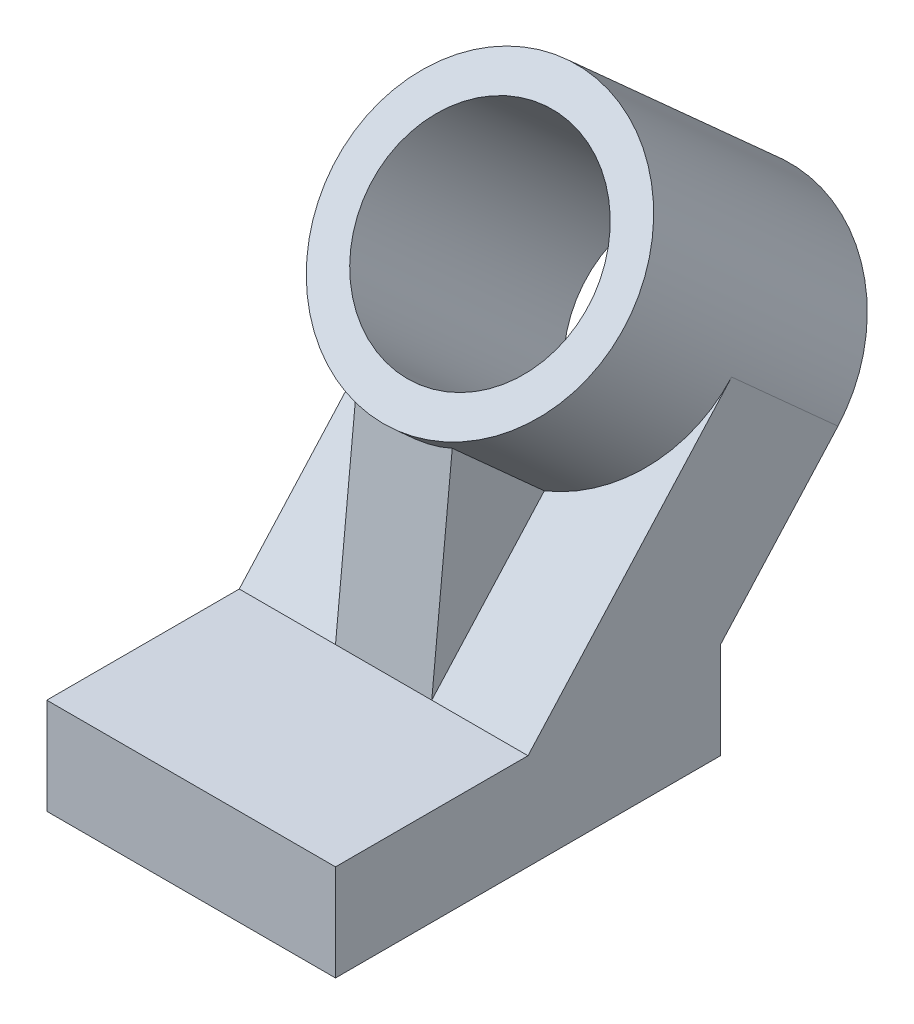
from build123d import *

# Parameters (mm, degrees)
BOSS_EXTRUDE1_DEPTH = 38.1
CUT_EXTRUDE5_DEPTH  = 38.1
BOSS_EXTRUDE2_START = 38.1
SKETCH7_R           = 38.1
BOSS_EXTRUDE2_DEPTH = 38.1
CUT_EXTRUDE6_REACH  = 185.935
SKETCH8_R           = 28.575
RIB12_REACH         = 181.588
SKETCH11_WALL_W     = 425.424454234
SKETCH11_WALL_H     = 25.4


with BuildPart() as part:
    # Sketch1 → Boss-Extrude1 (new, symmetric)
    with BuildSketch(Plane(origin=(0, 0, 0), x_dir=(0, 0, -1), z_dir=(1, 0, 0))):
        Polygon((-50.8, 0), (50.8, 0), (50.8, 25.4), (107.285550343, 88.133559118), (79.230527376, 113.39441526), (0, 25.4), (-50.8, 25.4), align=None)
    extrude(amount=BOSS_EXTRUDE1_DEPTH, both=True)

    # Sketch6 → Cut-Extrude5 (cut)
    with BuildSketch(Plane(origin=(0, 11.372488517, 12.630428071), x_dir=(1, 0, 0), z_dir=(0, 0.6691306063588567, 0.7431448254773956))):
        with BuildLine():
            ThreePointArc((-38.1, 99.184043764), (-26.940768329, 126.124812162), (9.8e-08, 137.284043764))
            Line((9.8e-08, 137.284043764), (-38.1, 137.284043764))
            Line((-38.1, 137.284043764), (-38.1, 99.184043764))
        make_face()
        with BuildLine():
            ThreePointArc((9.8e-08, 137.284043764), (26.940768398, 126.124812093), (38.1, 99.184043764))
            Line((38.1, 99.184043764), (38.1, 137.284043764))
            Line((38.1, 137.284043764), (9.8e-08, 137.284043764))
        make_face()
    extrude(amount=-CUT_EXTRUDE5_DEPTH, mode=Mode.SUBTRACT)

    # Sketch7 → Boss-Extrude2 (add)
    with BuildSketch(Plane(origin=(0, 11.372488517, 12.630428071), x_dir=(1, 0, 0), z_dir=(0, 0.6691306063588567, 0.7431448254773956)).offset(BOSS_EXTRUDE2_START)):
        with Locations(Location((0, 99.184043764, 0), (0, 0, 270))):
            Circle(SKETCH7_R)
    extrude(amount=-BOSS_EXTRUDE2_DEPTH)

    # Sketch8 → Cut-Extrude6 (cut, up to next)
    with BuildSketch(Plane(origin=(0, 36.866364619, 40.944245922), x_dir=(1, 0, 0), z_dir=(0, 0.6691306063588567, 0.7431448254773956)), mode=Mode.PRIVATE) as cut_extrude6_sk1:
        with Locations(Location((0, 99.184043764, 0), (0, 0, 270))):
            Circle(SKETCH8_R)
    cut_extrude6_tool1 = extrude(cut_extrude6_sk1.sketch, amount=-CUT_EXTRUDE6_REACH, mode=Mode.PRIVATE) & part.part
    add(cut_extrude6_tool1.solids().sort_by_distance((0, 110.574474, -25.422833))[0], mode=Mode.SUBTRACT)

    # Sketch11 wall → Rib12 (add, up to next)
    with BuildSketch(Plane(origin=(0, 57.369555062, -3.151213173), x_dir=(0, -0.995177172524, 0.098093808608), z_dir=(0, -0.098093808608, -0.995177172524)), mode=Mode.PRIVATE) as rib12_sk1:
        Rectangle(SKETCH11_WALL_W, SKETCH11_WALL_H)
    rib12_tool1 = extrude(rib12_sk1.sketch, amount=RIB12_REACH, mode=Mode.PRIVATE) - part.part
    add(rib12_tool1.solids().sort_by_distance((0, 57.369555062, -3.151213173))[0])


solid = part.part
